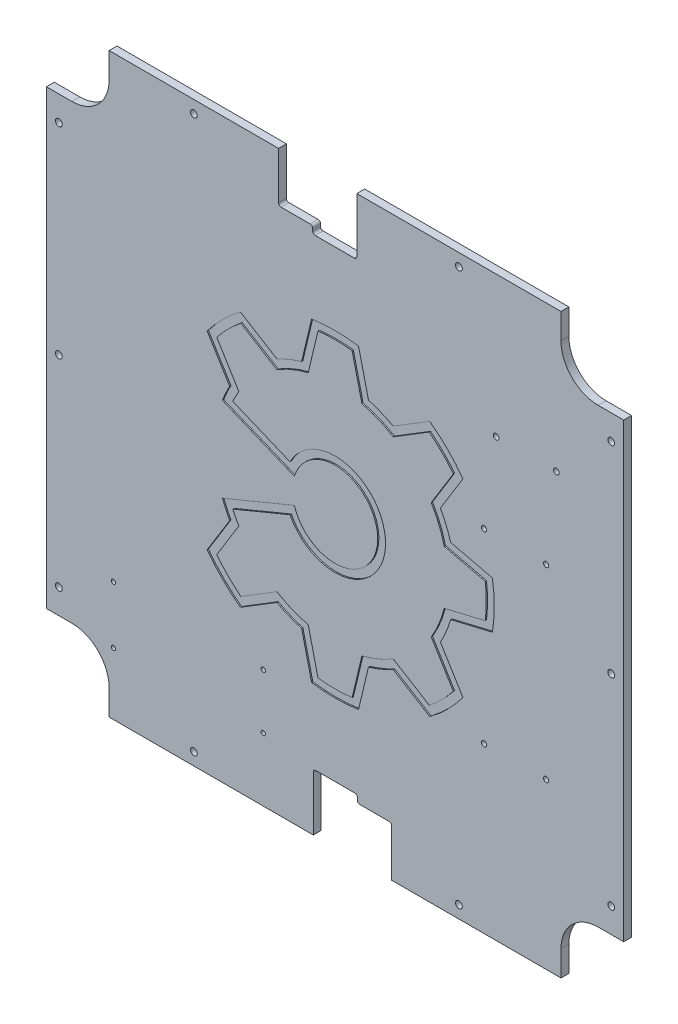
from build123d import *

# Parameters (mm, degrees)
SKETCH1_R           = 2.75
BOSS_EXTRUDE1_DEPTH = 6.35
SKETCH4_W           = 27.5
SKETCH4_H           = 6
BOSS_EXTRUDE2_DEPTH = 6.35
CUT_EXTRUDE1_DEPTH  = 6.35
CUT_EXTRUDE2_DEPTH  = 1
FILLET1_R           = 2
SKETCH5_R           = 2.25
SKETCH5_R_2         = 1.75
SKETCH5_R_3         = 2.1
CUT_EXTRUDE3_DEPTH  = 329.865964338


with BuildPart() as part:
    # Sketch1 → Boss-Extrude1 (new body)
    with BuildSketch(Plane.XY):
        Polygon((182, -212), (212, -212), (212, -182), (232.5, -182), (232.5, 0), (232.5, 182), (212, 182), (212, 212), (182, 212), (182, 232.5), (17.5, 232.5), (17.5, 186.5), (-45.5, 186.5), (-45.5, 232.5), (-182, 232.5), (-182, 212), (-212, 212), (-212, 182), (-232.5, 182), (-232.5, 0), (-232.5, -182), (-212, -182), (-212, -212), (-182, -212), (-182, -232.5), (-17.5, -232.5), (-17.5, -186.5), (45.5, -186.5), (45.5, -232.5), (182, -232.5), align=None)
        with Locations((-222.5, -162)):
            Circle(SKETCH1_R, mode=Mode.SUBTRACT)
        with Locations(Location((222.5, -162, 0), (0, 0, 180))):
            Circle(SKETCH1_R, mode=Mode.SUBTRACT)
        with Locations((222.5, 162)):
            Circle(SKETCH1_R, mode=Mode.SUBTRACT)
        with Locations(Location((-222.5, 162, 0), (0, 0, 180))):
            Circle(SKETCH1_R, mode=Mode.SUBTRACT)
        with Locations((-222.5, 0)):
            Circle(SKETCH1_R, mode=Mode.SUBTRACT)
        with Locations((222.5, 0)):
            Circle(SKETCH1_R, mode=Mode.SUBTRACT)
        with Locations((-113.75, 222.5)):
            Circle(SKETCH1_R, mode=Mode.SUBTRACT)
        with Locations((99.75, 222.5)):
            Circle(SKETCH1_R, mode=Mode.SUBTRACT)
        with Locations(Location((99.75, -222.5, 0), (0, 0, 180))):
            Circle(SKETCH1_R, mode=Mode.SUBTRACT)
        with Locations(Location((-113.75, -222.5, 0), (0, 0, 180))):
            Circle(SKETCH1_R, mode=Mode.SUBTRACT)
    extrude(amount=BOSS_EXTRUDE1_DEPTH)

    # Sketch4 → Boss-Extrude2 (add)
    with BuildSketch(Plane.XY.offset(6.35)):
        with Locations((31.75, -189.5)):
            Rectangle(SKETCH4_W, SKETCH4_H)
        with Locations((-31.75, 189.5)):
            Rectangle(SKETCH4_W, SKETCH4_H)
    extrude(amount=-BOSS_EXTRUDE2_DEPTH)

    # Sketch2 → Cut-Extrude1 (cut)
    with BuildSketch(Plane.XY.offset(6.35)):
        with BuildLine():
            Line((212, 212), (182, 212))
            ThreePointArc((182, 212), (190.786796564, 190.786796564), (212, 182))
            Line((212, 182), (212, 212))
        make_face()
        with BuildLine():
            Line((182, -212), (212, -212))
            Line((212, -212), (212, -182))
            ThreePointArc((212, -182), (190.786796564, -190.786796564), (182, -212))
        make_face()
        with BuildLine():
            Line((-212, -212), (-182, -212))
            ThreePointArc((-182, -212), (-190.786796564, -190.786796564), (-212, -182))
            Line((-212, -182), (-212, -212))
        make_face()
        with BuildLine():
            Line((-212, 212), (-212, 182))
            ThreePointArc((-212, 182), (-190.786796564, 190.786796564), (-182, 212))
            Line((-182, 212), (-212, 212))
        make_face()
    extrude(amount=-CUT_EXTRUDE1_DEPTH, mode=Mode.SUBTRACT)

    # Sketch3 → Cut-Extrude2 (cut)
    with BuildSketch(Plane.XY.offset(6.35)):
        with BuildLine():
            Line((-90.71398693, 34.138368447), (-32.791230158, 10.145977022))
            ThreePointArc((-32.791230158, 10.145977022), (34.325, 0), (-32.791230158, -10.145977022))
            Line((-32.791230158, -10.145977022), (-90.71398693, -34.138368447))
            ThreePointArc((-90.71398693, -34.138368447), (-88.022539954, -40.576940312), (-84.874800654, -46.805168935))
            Line((-84.874800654, -46.805168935), (-103.008511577, -76.276321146))
            ThreePointArc((-103.008511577, -76.276321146), (-90.633411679, -90.633411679), (-76.276321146, -103.008511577))
            Line((-76.276321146, -103.008511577), (-46.805168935, -84.874800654))
            ThreePointArc((-46.805168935, -84.874800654), (-37.091591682, -89.547023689), (-26.919294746, -93.111799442))
            Line((-26.919294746, -93.111799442), (-18.90251313, -126.773520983))
            ThreePointArc((-18.90251313, -126.773520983), (0, -128.175), (18.90251313, -126.773520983))
            Line((18.90251313, -126.773520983), (26.919294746, -93.111799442))
            ThreePointArc((26.919294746, -93.111799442), (37.091591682, -89.547023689), (46.805168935, -84.874800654))
            Line((46.805168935, -84.874800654), (76.276321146, -103.008511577))
            ThreePointArc((76.276321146, -103.008511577), (90.633411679, -90.633411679), (103.008511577, -76.276321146))
            Line((103.008511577, -76.276321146), (84.874800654, -46.805168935))
            ThreePointArc((84.874800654, -46.805168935), (89.547023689, -37.091591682), (93.111799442, -26.919294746))
            Line((93.111799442, -26.919294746), (126.773520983, -18.90251313))
            ThreePointArc((126.773520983, -18.90251313), (128.175, 0), (126.773520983, 18.90251313))
            Line((126.773520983, 18.90251313), (93.111799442, 26.919294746))
            ThreePointArc((93.111799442, 26.919294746), (89.547023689, 37.091591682), (84.874800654, 46.805168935))
            Line((84.874800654, 46.805168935), (103.008511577, 76.276321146))
            ThreePointArc((103.008511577, 76.276321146), (90.633411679, 90.633411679), (76.276321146, 103.008511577))
            Line((76.276321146, 103.008511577), (46.805168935, 84.874800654))
            ThreePointArc((46.805168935, 84.874800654), (37.091591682, 89.547023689), (26.919294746, 93.111799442))
            Line((26.919294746, 93.111799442), (18.90251313, 126.773520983))
            ThreePointArc((18.90251313, 126.773520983), (0, 128.175), (-18.90251313, 126.773520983))
            Line((-18.90251313, 126.773520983), (-26.919294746, 93.111799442))
            ThreePointArc((-26.919294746, 93.111799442), (-37.091591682, 89.547023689), (-46.805168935, 84.874800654))
            Line((-46.805168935, 84.874800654), (-76.276321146, 103.008511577))
            ThreePointArc((-76.276321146, 103.008511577), (-90.633411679, 90.633411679), (-103.008511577, 76.276321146))
            Line((-103.008511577, 76.276321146), (-84.874800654, 46.805168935))
            ThreePointArc((-84.874800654, 46.805168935), (-88.022539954, 40.576940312), (-90.71398693, 34.138368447))
        make_face()
        with BuildLine():
            Line((-82.41394096, 37.57356731), (-36.249121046, 18.451472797))
            ThreePointArc((-36.249121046, 18.451472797), (40.675, 0), (-36.249121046, -18.451472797))
            Line((-36.249121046, -18.451472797), (-82.41394096, -37.57356731))
            ThreePointArc((-82.41394096, -37.57356731), (-80.084171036, -42.312600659), (-77.482180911, -46.907806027))
            Line((-77.482180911, -46.907806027), (-95.308362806, -75.879157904))
            ThreePointArc((-95.308362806, -75.879157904), (-86.143283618, -86.143283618), (-75.879157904, -95.308362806))
            Line((-75.879157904, -95.308362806), (-46.907806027, -77.482180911))
            ThreePointArc((-46.907806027, -77.482180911), (-34.661551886, -83.680388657), (-21.619347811, -87.957003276))
            Line((-21.619347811, -87.957003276), (-13.73852254, -121.047856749))
            ThreePointArc((-13.73852254, -121.047856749), (0, -121.825), (13.73852254, -121.047856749))
            Line((13.73852254, -121.047856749), (21.619347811, -87.957003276))
            ThreePointArc((21.619347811, -87.957003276), (34.661551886, -83.680388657), (46.907806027, -77.482180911))
            Line((46.907806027, -77.482180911), (75.879157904, -95.308362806))
            ThreePointArc((75.879157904, -95.308362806), (86.143283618, -86.143283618), (95.308362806, -75.879157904))
            Line((95.308362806, -75.879157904), (77.482180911, -46.907806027))
            ThreePointArc((77.482180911, -46.907806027), (83.680388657, -34.661551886), (87.957003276, -21.619347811))
            Line((87.957003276, -21.619347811), (121.047856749, -13.73852254))
            ThreePointArc((121.047856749, -13.73852254), (121.825, 0), (121.047856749, 13.73852254))
            Line((121.047856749, 13.73852254), (87.957003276, 21.619347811))
            ThreePointArc((87.957003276, 21.619347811), (83.680388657, 34.661551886), (77.482180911, 46.907806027))
            Line((77.482180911, 46.907806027), (95.308362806, 75.879157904))
            ThreePointArc((95.308362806, 75.879157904), (86.143283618, 86.143283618), (75.879157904, 95.308362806))
            Line((75.879157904, 95.308362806), (46.907806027, 77.482180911))
            ThreePointArc((46.907806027, 77.482180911), (34.661551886, 83.680388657), (21.619347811, 87.957003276))
            Line((21.619347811, 87.957003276), (13.73852254, 121.047856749))
            ThreePointArc((13.73852254, 121.047856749), (0, 121.825), (-13.73852254, 121.047856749))
            Line((-13.73852254, 121.047856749), (-21.619347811, 87.957003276))
            ThreePointArc((-21.619347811, 87.957003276), (-34.661551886, 83.680388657), (-46.907806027, 77.482180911))
            Line((-46.907806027, 77.482180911), (-75.879157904, 95.308362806))
            ThreePointArc((-75.879157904, 95.308362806), (-86.143283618, 86.143283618), (-95.308362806, 75.879157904))
            Line((-95.308362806, 75.879157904), (-77.482180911, 46.907806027))
            ThreePointArc((-77.482180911, 46.907806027), (-80.084171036, 42.312600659), (-82.41394096, 37.57356731))
        make_face(mode=Mode.SUBTRACT)
    extrude(amount=-CUT_EXTRUDE2_DEPTH, mode=Mode.SUBTRACT)

    # Fillet1
    fillet1_edges = [part.edges().sort_by_distance(p)[0] for p in [
        (45.5, -192.5, 3.175),
        (18, -192.5, 3.175),
        (18, -186.5, 3.175),
        (-45.5, 192.5, 3.175),
        (-18, 192.5, 3.175),
        (-18, 186.5, 3.175),
        (17.5, 186.5, 3.175),
        (-17.5, -186.5, 3.175),
    ]]
    fillet(fillet1_edges, radius=FILLET1_R)

    # Sketch5 → Cut-Extrude3 (cut, through all)
    with BuildSketch(Plane(origin=(0, 0, 0), x_dir=(-1, 0, 0), z_dir=(0, 0, -1))):
        with Locations((-129.75, 119)):
            Circle(SKETCH5_R)
        with Locations((57.83, -137.299993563)):
            Circle(SKETCH5_R_2)
        with Locations((178.5, -136.299993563)):
            Circle(SKETCH5_R_2)
        with Locations((-178.25, 119)):
            Circle(SKETCH5_R)
        with Locations((178.5, -182.499993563)):
            Circle(SKETCH5_R_2)
        with Locations((57.83, -181.499993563)):
            Circle(SKETCH5_R_2)
        with Locations((-170, 50)):
            Circle(SKETCH5_R_3)
        with Locations((-120, 50)):
            Circle(SKETCH5_R_3)
        with Locations((-170, -100)):
            Circle(SKETCH5_R_3)
        with Locations((-120, -100)):
            Circle(SKETCH5_R_3)
    extrude(amount=-CUT_EXTRUDE3_DEPTH, mode=Mode.SUBTRACT)


solid = part.part
